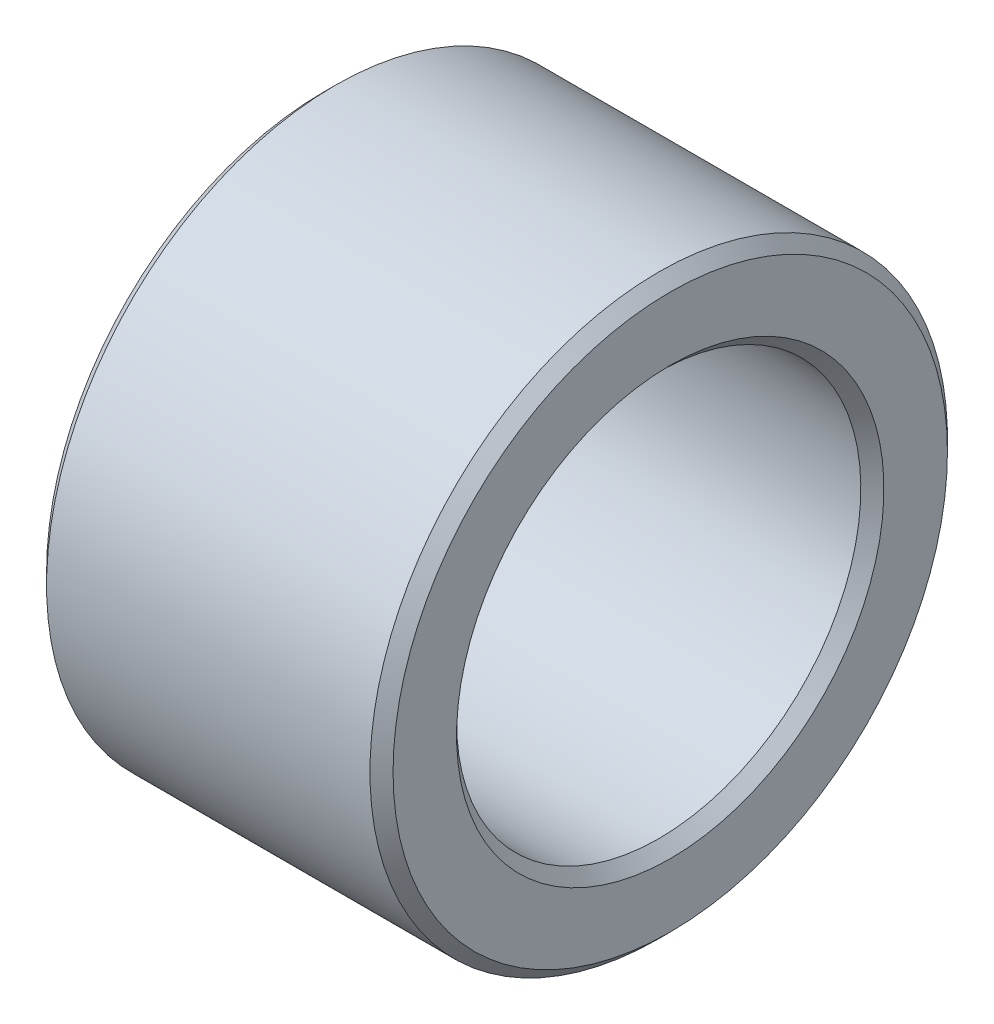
ISO-10303-21;
HEADER;
FILE_DESCRIPTION(('STEP AP214'),'2;1');
FILE_NAME('part.step','',(''),(''),'','','');
FILE_SCHEMA(('AUTOMOTIVE_DESIGN { 1 0 10303 214 1 1 1 1 }'));
ENDSEC;
DATA;
#1=APPLICATION_CONTEXT('core data for automotive mechanical design processes');
#2=APPLICATION_PROTOCOL_DEFINITION('international standard','automotive_design',2000,#1);
#3=PRODUCT_CONTEXT('',#1,'mechanical');
#4=PRODUCT('Part','Part','',(#3));
#5=PRODUCT_RELATED_PRODUCT_CATEGORY('part','',(#4));
#6=PRODUCT_DEFINITION_FORMATION('','',#4);
#7=PRODUCT_DEFINITION_CONTEXT('part definition',#1,'design');
#8=PRODUCT_DEFINITION('design','',#6,#7);
#9=PRODUCT_DEFINITION_SHAPE('','',#8);
#10=(LENGTH_UNIT() NAMED_UNIT(*) SI_UNIT(.MILLI.,.METRE.));
#11=(NAMED_UNIT(*) PLANE_ANGLE_UNIT() SI_UNIT($,.RADIAN.));
#12=(NAMED_UNIT(*) SI_UNIT($,.STERADIAN.) SOLID_ANGLE_UNIT());
#13=UNCERTAINTY_MEASURE_WITH_UNIT(LENGTH_MEASURE(1.E-05),#10,'distance_accuracy_value','');
#14=(GEOMETRIC_REPRESENTATION_CONTEXT(3) GLOBAL_UNCERTAINTY_ASSIGNED_CONTEXT((#13)) GLOBAL_UNIT_ASSIGNED_CONTEXT((#10,
#11,#12)) REPRESENTATION_CONTEXT('',''));
#15=CARTESIAN_POINT('',(0.,0.,0.));
#16=DIRECTION('',(0.,0.,1.));
#17=DIRECTION('',(1.,0.,0.));
#18=AXIS2_PLACEMENT_3D('',#15,#16,#17);
#19=CARTESIAN_POINT('',(0.,-8.5,0.));
#20=DIRECTION('',(-1.,0.,0.));
#21=DIRECTION('',(0.,1.,0.));
#22=AXIS2_PLACEMENT_3D('',#19,#20,#21);
#23=PLANE('',#22);
#24=CARTESIAN_POINT('',(0.,0.,0.));
#25=DIRECTION('',(1.,0.,0.));
#26=DIRECTION('',(0.,-1.,0.));
#27=AXIS2_PLACEMENT_3D('',#24,#25,#26);
#28=CIRCLE('',#27,7.4);
#29=CARTESIAN_POINT('',(0.,-7.4,0.));
#30=VERTEX_POINT('',#29);
#31=EDGE_CURVE('E9',#30,#30,#28,.T.);
#32=ORIENTED_EDGE('',*,*,#31,.T.);
#33=EDGE_LOOP('',(#32));
#34=FACE_BOUND('',#33,.T.);
#35=CARTESIAN_POINT('',(0.,0.,0.));
#36=DIRECTION('',(1.,0.,0.));
#37=DIRECTION('',(0.,-1.,0.));
#38=AXIS2_PLACEMENT_3D('',#35,#36,#37);
#39=CIRCLE('',#38,9.6);
#40=CARTESIAN_POINT('',(0.,-9.6,0.));
#41=VERTEX_POINT('',#40);
#42=EDGE_CURVE('E53',#41,#41,#39,.T.);
#43=ORIENTED_EDGE('',*,*,#42,.F.);
#44=EDGE_LOOP('',(#43));
#45=FACE_BOUND('',#44,.T.);
#46=ADVANCED_FACE('F15',(#34,#45),#23,.T.);
#47=CARTESIAN_POINT('',(0.2,0.,0.));
#48=DIRECTION('',(-1.,0.,0.));
#49=DIRECTION('',(0.,-1.,0.));
#50=AXIS2_PLACEMENT_3D('',#47,#48,#49);
#51=CONICAL_SURFACE('',#50,7.2,0.785398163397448);
#52=CARTESIAN_POINT('',(0.4,0.,0.));
#53=DIRECTION('',(1.,0.,0.));
#54=DIRECTION('',(0.,-1.,0.));
#55=AXIS2_PLACEMENT_3D('',#52,#53,#54);
#56=CIRCLE('',#55,7.);
#57=CARTESIAN_POINT('',(0.4,-7.,0.));
#58=VERTEX_POINT('',#57);
#59=EDGE_CURVE('E22',#58,#58,#56,.T.);
#60=ORIENTED_EDGE('',*,*,#59,.T.);
#61=EDGE_LOOP('',(#60));
#62=FACE_BOUND('',#61,.T.);
#63=ORIENTED_EDGE('',*,*,#31,.F.);
#64=EDGE_LOOP('',(#63));
#65=FACE_BOUND('',#64,.T.);
#66=ADVANCED_FACE('F82',(#62,#65),#51,.F.);
#67=CARTESIAN_POINT('',(6.,0.,0.));
#68=DIRECTION('',(-1.,0.,0.));
#69=DIRECTION('',(0.,-1.,0.));
#70=AXIS2_PLACEMENT_3D('',#67,#68,#69);
#71=CYLINDRICAL_SURFACE('',#70,7.);
#72=CARTESIAN_POINT('',(11.6,0.,0.));
#73=DIRECTION('',(1.,0.,0.));
#74=DIRECTION('',(0.,-1.,0.));
#75=AXIS2_PLACEMENT_3D('',#72,#73,#74);
#76=CIRCLE('',#75,7.);
#77=CARTESIAN_POINT('',(11.6,-7.,0.));
#78=VERTEX_POINT('',#77);
#79=EDGE_CURVE('E58',#78,#78,#76,.T.);
#80=ORIENTED_EDGE('',*,*,#79,.T.);
#81=EDGE_LOOP('',(#80));
#82=FACE_BOUND('',#81,.T.);
#83=ORIENTED_EDGE('',*,*,#59,.F.);
#84=EDGE_LOOP('',(#83));
#85=FACE_BOUND('',#84,.T.);
#86=ADVANCED_FACE('F66',(#82,#85),#71,.F.);
#87=CARTESIAN_POINT('',(11.8,0.,0.));
#88=DIRECTION('',(1.,0.,0.));
#89=DIRECTION('',(0.,-1.,0.));
#90=AXIS2_PLACEMENT_3D('',#87,#88,#89);
#91=CONICAL_SURFACE('',#90,7.2,0.785398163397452);
#92=CARTESIAN_POINT('',(12.,0.,0.));
#93=DIRECTION('',(1.,0.,0.));
#94=DIRECTION('',(0.,-1.,0.));
#95=AXIS2_PLACEMENT_3D('',#92,#93,#94);
#96=CIRCLE('',#95,7.4);
#97=CARTESIAN_POINT('',(12.,-7.4,0.));
#98=VERTEX_POINT('',#97);
#99=EDGE_CURVE('E63',#98,#98,#96,.T.);
#100=ORIENTED_EDGE('',*,*,#99,.T.);
#101=EDGE_LOOP('',(#100));
#102=FACE_BOUND('',#101,.T.);
#103=ORIENTED_EDGE('',*,*,#79,.F.);
#104=EDGE_LOOP('',(#103));
#105=FACE_BOUND('',#104,.T.);
#106=ADVANCED_FACE('F69',(#102,#105),#91,.F.);
#107=CARTESIAN_POINT('',(12.,-8.5,0.));
#108=DIRECTION('',(1.,0.,0.));
#109=DIRECTION('',(0.,-1.,0.));
#110=AXIS2_PLACEMENT_3D('',#107,#108,#109);
#111=PLANE('',#110);
#112=CARTESIAN_POINT('',(12.,0.,0.));
#113=DIRECTION('',(1.,0.,0.));
#114=DIRECTION('',(0.,-1.,0.));
#115=AXIS2_PLACEMENT_3D('',#112,#113,#114);
#116=CIRCLE('',#115,9.6);
#117=CARTESIAN_POINT('',(12.,-9.6,0.));
#118=VERTEX_POINT('',#117);
#119=EDGE_CURVE('E61',#118,#118,#116,.T.);
#120=ORIENTED_EDGE('',*,*,#119,.T.);
#121=EDGE_LOOP('',(#120));
#122=FACE_BOUND('',#121,.T.);
#123=ORIENTED_EDGE('',*,*,#99,.F.);
#124=EDGE_LOOP('',(#123));
#125=FACE_BOUND('',#124,.T.);
#126=ADVANCED_FACE('F71',(#122,#125),#111,.T.);
#127=CARTESIAN_POINT('',(11.8,0.,0.));
#128=DIRECTION('',(-1.,0.,0.));
#129=DIRECTION('',(0.,-1.,0.));
#130=AXIS2_PLACEMENT_3D('',#127,#128,#129);
#131=CONICAL_SURFACE('',#130,9.8,0.785398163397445);
#132=CARTESIAN_POINT('',(11.6,0.,0.));
#133=DIRECTION('',(1.,0.,0.));
#134=DIRECTION('',(0.,-1.,0.));
#135=AXIS2_PLACEMENT_3D('',#132,#133,#134);
#136=CIRCLE('',#135,10.);
#137=CARTESIAN_POINT('',(11.6,-10.,0.));
#138=VERTEX_POINT('',#137);
#139=EDGE_CURVE('E55',#138,#138,#136,.T.);
#140=ORIENTED_EDGE('',*,*,#139,.T.);
#141=EDGE_LOOP('',(#140));
#142=FACE_BOUND('',#141,.T.);
#143=ORIENTED_EDGE('',*,*,#119,.F.);
#144=EDGE_LOOP('',(#143));
#145=FACE_BOUND('',#144,.T.);
#146=ADVANCED_FACE('F79',(#142,#145),#131,.T.);
#147=CARTESIAN_POINT('',(6.,0.,0.));
#148=DIRECTION('',(-1.,0.,0.));
#149=DIRECTION('',(0.,-1.,0.));
#150=AXIS2_PLACEMENT_3D('',#147,#148,#149);
#151=CYLINDRICAL_SURFACE('',#150,10.);
#152=CARTESIAN_POINT('',(0.4,0.,0.));
#153=DIRECTION('',(1.,0.,0.));
#154=DIRECTION('',(0.,-1.,0.));
#155=AXIS2_PLACEMENT_3D('',#152,#153,#154);
#156=CIRCLE('',#155,10.);
#157=CARTESIAN_POINT('',(0.4,-10.,0.));
#158=VERTEX_POINT('',#157);
#159=EDGE_CURVE('E49',#158,#158,#156,.T.);
#160=ORIENTED_EDGE('',*,*,#159,.T.);
#161=EDGE_LOOP('',(#160));
#162=FACE_BOUND('',#161,.T.);
#163=ORIENTED_EDGE('',*,*,#139,.F.);
#164=EDGE_LOOP('',(#163));
#165=FACE_BOUND('',#164,.T.);
#166=ADVANCED_FACE('F50',(#162,#165),#151,.T.);
#167=CARTESIAN_POINT('',(0.2,0.,0.));
#168=DIRECTION('',(1.,0.,0.));
#169=DIRECTION('',(0.,-1.,0.));
#170=AXIS2_PLACEMENT_3D('',#167,#168,#169);
#171=CONICAL_SURFACE('',#170,9.8,0.785398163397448);
#172=ORIENTED_EDGE('',*,*,#42,.T.);
#173=EDGE_LOOP('',(#172));
#174=FACE_BOUND('',#173,.T.);
#175=ORIENTED_EDGE('',*,*,#159,.F.);
#176=EDGE_LOOP('',(#175));
#177=FACE_BOUND('',#176,.T.);
#178=ADVANCED_FACE('F92',(#174,#177),#171,.T.);
#179=CLOSED_SHELL('',(#46,#66,#86,#106,#126,#146,#166,#178));
#180=MANIFOLD_SOLID_BREP('B1',#179);
#181=ADVANCED_BREP_SHAPE_REPRESENTATION('',(#18,#180),#14);
#182=SHAPE_DEFINITION_REPRESENTATION(#9,#181);
ENDSEC;
END-ISO-10303-21;
